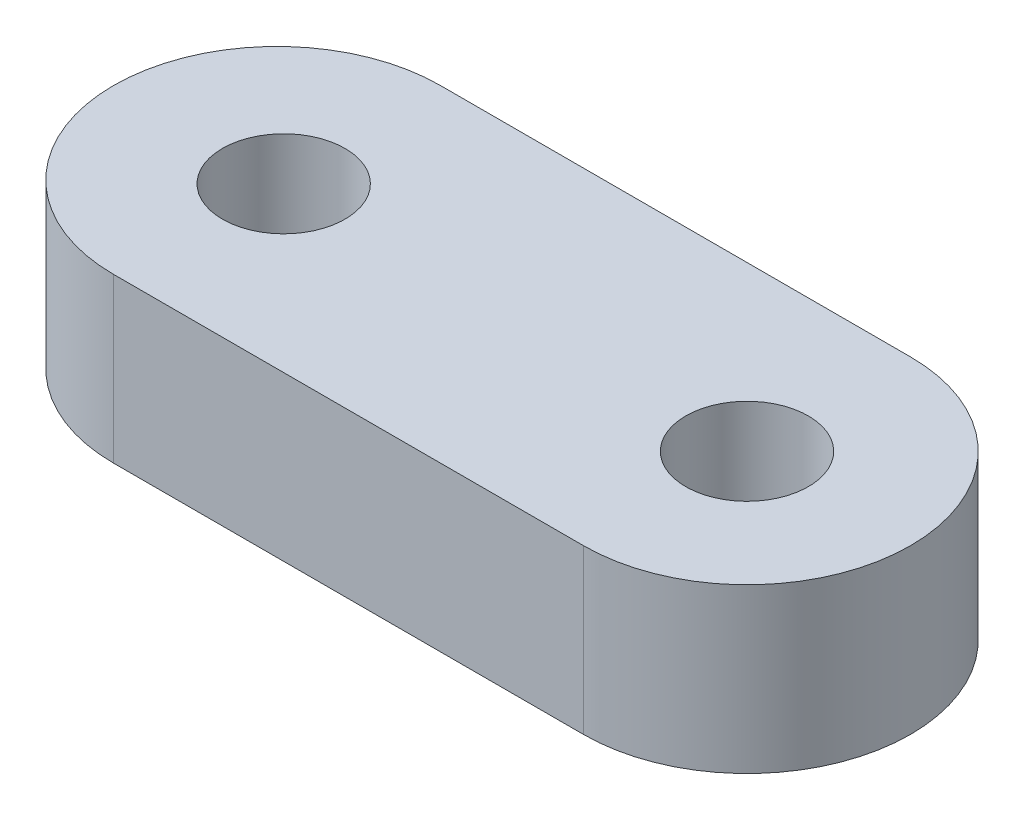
ISO-10303-21;
HEADER;
FILE_DESCRIPTION(('STEP AP214'),'2;1');
FILE_NAME('part.step','',(''),(''),'','','');
FILE_SCHEMA(('AUTOMOTIVE_DESIGN { 1 0 10303 214 1 1 1 1 }'));
ENDSEC;
DATA;
#1=APPLICATION_CONTEXT('core data for automotive mechanical design processes');
#2=APPLICATION_PROTOCOL_DEFINITION('international standard','automotive_design',2000,#1);
#3=PRODUCT_CONTEXT('',#1,'mechanical');
#4=PRODUCT('Part','Part','',(#3));
#5=PRODUCT_RELATED_PRODUCT_CATEGORY('part','',(#4));
#6=PRODUCT_DEFINITION_FORMATION('','',#4);
#7=PRODUCT_DEFINITION_CONTEXT('part definition',#1,'design');
#8=PRODUCT_DEFINITION('design','',#6,#7);
#9=PRODUCT_DEFINITION_SHAPE('','',#8);
#10=(LENGTH_UNIT() NAMED_UNIT(*) SI_UNIT(.MILLI.,.METRE.));
#11=(NAMED_UNIT(*) PLANE_ANGLE_UNIT() SI_UNIT($,.RADIAN.));
#12=(NAMED_UNIT(*) SI_UNIT($,.STERADIAN.) SOLID_ANGLE_UNIT());
#13=UNCERTAINTY_MEASURE_WITH_UNIT(LENGTH_MEASURE(1.E-05),#10,'distance_accuracy_value','');
#14=(GEOMETRIC_REPRESENTATION_CONTEXT(3) GLOBAL_UNCERTAINTY_ASSIGNED_CONTEXT((#13)) GLOBAL_UNIT_ASSIGNED_CONTEXT((#10,
#11,#12)) REPRESENTATION_CONTEXT('',''));
#15=CARTESIAN_POINT('',(0.,0.,0.));
#16=DIRECTION('',(0.,0.,1.));
#17=DIRECTION('',(1.,0.,0.));
#18=AXIS2_PLACEMENT_3D('',#15,#16,#17);
#19=CARTESIAN_POINT('',(22.67,4.,0.));
#20=DIRECTION('',(0.,-1.,0.));
#21=DIRECTION('',(1.,0.,0.));
#22=AXIS2_PLACEMENT_3D('',#19,#20,#21);
#23=CYLINDRICAL_SURFACE('',#22,8.);
#24=DIRECTION('',(0.,-1.,0.));
#25=VECTOR('',#24,1.);
#26=CARTESIAN_POINT('',(22.67,4.,8.));
#27=LINE('',#26,#25);
#28=CARTESIAN_POINT('',(22.67,-4.,8.));
#29=VERTEX_POINT('',#28);
#30=CARTESIAN_POINT('',(22.67,4.,8.));
#31=VERTEX_POINT('',#30);
#32=EDGE_CURVE('E66',#29,#31,#27,.F.);
#33=ORIENTED_EDGE('',*,*,#32,.F.);
#34=CARTESIAN_POINT('',(22.67,-4.,0.));
#35=DIRECTION('',(0.,-1.,0.));
#36=DIRECTION('',(1.,0.,0.));
#37=AXIS2_PLACEMENT_3D('',#34,#35,#36);
#38=CIRCLE('',#37,8.);
#39=CARTESIAN_POINT('',(22.67,-4.,-8.));
#40=VERTEX_POINT('',#39);
#41=EDGE_CURVE('E18',#29,#40,#38,.F.);
#42=ORIENTED_EDGE('',*,*,#41,.T.);
#43=DIRECTION('',(0.,1.,0.));
#44=VECTOR('',#43,1.);
#45=CARTESIAN_POINT('',(22.67,4.,-8.));
#46=LINE('',#45,#44);
#47=CARTESIAN_POINT('',(22.67,4.,-8.));
#48=VERTEX_POINT('',#47);
#49=EDGE_CURVE('E53',#48,#40,#46,.F.);
#50=ORIENTED_EDGE('',*,*,#49,.F.);
#51=CARTESIAN_POINT('',(22.67,4.,0.));
#52=DIRECTION('',(0.,-1.,0.));
#53=DIRECTION('',(1.,0.,0.));
#54=AXIS2_PLACEMENT_3D('',#51,#52,#53);
#55=CIRCLE('',#54,8.);
#56=EDGE_CURVE('E78',#31,#48,#55,.F.);
#57=ORIENTED_EDGE('',*,*,#56,.F.);
#58=EDGE_LOOP('',(#33,#42,#50,#57));
#59=FACE_BOUND('',#58,.T.);
#60=ADVANCED_FACE('F14',(#59),#23,.T.);
#61=CARTESIAN_POINT('',(-8.33,4.,-8.));
#62=DIRECTION('',(0.,0.,-1.));
#63=DIRECTION('',(0.,1.,0.));
#64=AXIS2_PLACEMENT_3D('',#61,#62,#63);
#65=PLANE('',#64);
#66=ORIENTED_EDGE('',*,*,#49,.T.);
#67=DIRECTION('',(1.,0.,0.));
#68=VECTOR('',#67,1.);
#69=CARTESIAN_POINT('',(-8.33,-4.,-8.));
#70=LINE('',#69,#68);
#71=CARTESIAN_POINT('',(-0.33,-4.,-8.));
#72=VERTEX_POINT('',#71);
#73=EDGE_CURVE('E57',#40,#72,#70,.F.);
#74=ORIENTED_EDGE('',*,*,#73,.T.);
#75=DIRECTION('',(0.,-1.,0.));
#76=VECTOR('',#75,1.);
#77=CARTESIAN_POINT('',(-0.33,4.,-8.));
#78=LINE('',#77,#76);
#79=CARTESIAN_POINT('',(-0.33,4.,-8.));
#80=VERTEX_POINT('',#79);
#81=EDGE_CURVE('E60',#80,#72,#78,.T.);
#82=ORIENTED_EDGE('',*,*,#81,.F.);
#83=DIRECTION('',(-1.,0.,0.));
#84=VECTOR('',#83,1.);
#85=CARTESIAN_POINT('',(-8.33,4.,-8.));
#86=LINE('',#85,#84);
#87=EDGE_CURVE('E58',#48,#80,#86,.T.);
#88=ORIENTED_EDGE('',*,*,#87,.F.);
#89=EDGE_LOOP('',(#66,#74,#82,#88));
#90=FACE_BOUND('',#89,.T.);
#91=ADVANCED_FACE('F55',(#90),#65,.T.);
#92=CARTESIAN_POINT('',(-0.329999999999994,4.,0.));
#93=DIRECTION('',(0.,-1.,0.));
#94=DIRECTION('',(1.,0.,0.));
#95=AXIS2_PLACEMENT_3D('',#92,#93,#94);
#96=CYLINDRICAL_SURFACE('',#95,8.);
#97=DIRECTION('',(0.,-1.,0.));
#98=VECTOR('',#97,1.);
#99=CARTESIAN_POINT('',(-0.329999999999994,4.,8.));
#100=LINE('',#99,#98);
#101=CARTESIAN_POINT('',(-0.329999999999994,4.,8.));
#102=VERTEX_POINT('',#101);
#103=CARTESIAN_POINT('',(-0.329999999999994,-4.,8.));
#104=VERTEX_POINT('',#103);
#105=EDGE_CURVE('E80',#102,#104,#100,.T.);
#106=ORIENTED_EDGE('',*,*,#105,.F.);
#107=CARTESIAN_POINT('',(-0.329999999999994,4.,0.));
#108=DIRECTION('',(0.,-1.,0.));
#109=DIRECTION('',(1.,0.,0.));
#110=AXIS2_PLACEMENT_3D('',#107,#108,#109);
#111=CIRCLE('',#110,8.);
#112=EDGE_CURVE('E24',#80,#102,#111,.F.);
#113=ORIENTED_EDGE('',*,*,#112,.F.);
#114=ORIENTED_EDGE('',*,*,#81,.T.);
#115=CARTESIAN_POINT('',(-0.329999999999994,-4.,0.));
#116=DIRECTION('',(0.,-1.,0.));
#117=DIRECTION('',(1.,0.,0.));
#118=AXIS2_PLACEMENT_3D('',#115,#116,#117);
#119=CIRCLE('',#118,8.);
#120=EDGE_CURVE('E74',#72,#104,#119,.F.);
#121=ORIENTED_EDGE('',*,*,#120,.T.);
#122=EDGE_LOOP('',(#106,#113,#114,#121));
#123=FACE_BOUND('',#122,.T.);
#124=ADVANCED_FACE('F111',(#123),#96,.T.);
#125=CARTESIAN_POINT('',(-8.33,4.,8.));
#126=DIRECTION('',(0.,0.,1.));
#127=DIRECTION('',(0.,-1.,0.));
#128=AXIS2_PLACEMENT_3D('',#125,#126,#127);
#129=PLANE('',#128);
#130=DIRECTION('',(-1.,0.,0.));
#131=VECTOR('',#130,1.);
#132=CARTESIAN_POINT('',(-8.33,4.,8.));
#133=LINE('',#132,#131);
#134=EDGE_CURVE('E9',#102,#31,#133,.F.);
#135=ORIENTED_EDGE('',*,*,#134,.F.);
#136=ORIENTED_EDGE('',*,*,#105,.T.);
#137=DIRECTION('',(1.,0.,0.));
#138=VECTOR('',#137,1.);
#139=CARTESIAN_POINT('',(-8.33,-4.,8.));
#140=LINE('',#139,#138);
#141=EDGE_CURVE('E61',#104,#29,#140,.T.);
#142=ORIENTED_EDGE('',*,*,#141,.T.);
#143=ORIENTED_EDGE('',*,*,#32,.T.);
#144=EDGE_LOOP('',(#135,#136,#142,#143));
#145=FACE_BOUND('',#144,.T.);
#146=ADVANCED_FACE('F102',(#145),#129,.T.);
#147=CARTESIAN_POINT('',(-8.33,4.,-8.));
#148=DIRECTION('',(0.,1.,0.));
#149=DIRECTION('',(-1.,0.,0.));
#150=AXIS2_PLACEMENT_3D('',#147,#148,#149);
#151=PLANE('',#150);
#152=ORIENTED_EDGE('',*,*,#112,.T.);
#153=ORIENTED_EDGE('',*,*,#134,.T.);
#154=ORIENTED_EDGE('',*,*,#56,.T.);
#155=ORIENTED_EDGE('',*,*,#87,.T.);
#156=EDGE_LOOP('',(#152,#153,#154,#155));
#157=FACE_BOUND('',#156,.T.);
#158=CARTESIAN_POINT('',(0.,4.,0.));
#159=DIRECTION('',(0.,1.,0.));
#160=DIRECTION('',(-1.,0.,0.));
#161=AXIS2_PLACEMENT_3D('',#158,#159,#160);
#162=CIRCLE('',#161,3.);
#163=CARTESIAN_POINT('',(-3.,4.,0.));
#164=VERTEX_POINT('',#163);
#165=EDGE_CURVE('E88',#164,#164,#162,.T.);
#166=ORIENTED_EDGE('',*,*,#165,.F.);
#167=EDGE_LOOP('',(#166));
#168=FACE_BOUND('',#167,.T.);
#169=CARTESIAN_POINT('',(22.67,4.,0.));
#170=DIRECTION('',(0.,1.,0.));
#171=DIRECTION('',(-1.,0.,0.));
#172=AXIS2_PLACEMENT_3D('',#169,#170,#171);
#173=CIRCLE('',#172,3.);
#174=CARTESIAN_POINT('',(19.67,4.,0.));
#175=VERTEX_POINT('',#174);
#176=EDGE_CURVE('E94',#175,#175,#173,.T.);
#177=ORIENTED_EDGE('',*,*,#176,.F.);
#178=EDGE_LOOP('',(#177));
#179=FACE_BOUND('',#178,.T.);
#180=ADVANCED_FACE('F100',(#157,#168,#179),#151,.T.);
#181=CARTESIAN_POINT('',(-8.33,-4.,-8.));
#182=DIRECTION('',(0.,1.,0.));
#183=DIRECTION('',(-1.,0.,0.));
#184=AXIS2_PLACEMENT_3D('',#181,#182,#183);
#185=PLANE('',#184);
#186=ORIENTED_EDGE('',*,*,#41,.F.);
#187=ORIENTED_EDGE('',*,*,#141,.F.);
#188=ORIENTED_EDGE('',*,*,#120,.F.);
#189=ORIENTED_EDGE('',*,*,#73,.F.);
#190=EDGE_LOOP('',(#186,#187,#188,#189));
#191=FACE_BOUND('',#190,.T.);
#192=CARTESIAN_POINT('',(0.,-4.,0.));
#193=DIRECTION('',(0.,1.,0.));
#194=DIRECTION('',(-1.,0.,0.));
#195=AXIS2_PLACEMENT_3D('',#192,#193,#194);
#196=CIRCLE('',#195,3.);
#197=CARTESIAN_POINT('',(-3.,-4.,0.));
#198=VERTEX_POINT('',#197);
#199=EDGE_CURVE('E70',#198,#198,#196,.F.);
#200=ORIENTED_EDGE('',*,*,#199,.F.);
#201=EDGE_LOOP('',(#200));
#202=FACE_BOUND('',#201,.T.);
#203=CARTESIAN_POINT('',(22.67,-4.,0.));
#204=DIRECTION('',(0.,1.,0.));
#205=DIRECTION('',(-1.,0.,0.));
#206=AXIS2_PLACEMENT_3D('',#203,#204,#205);
#207=CIRCLE('',#206,3.);
#208=CARTESIAN_POINT('',(19.67,-4.,0.));
#209=VERTEX_POINT('',#208);
#210=EDGE_CURVE('E91',#209,#209,#207,.F.);
#211=ORIENTED_EDGE('',*,*,#210,.F.);
#212=EDGE_LOOP('',(#211));
#213=FACE_BOUND('',#212,.T.);
#214=ADVANCED_FACE('F16',(#191,#202,#213),#185,.F.);
#215=CARTESIAN_POINT('',(0.,-18.6484323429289,0.));
#216=DIRECTION('',(0.,1.,0.));
#217=DIRECTION('',(-1.,0.,0.));
#218=AXIS2_PLACEMENT_3D('',#215,#216,#217);
#219=CYLINDRICAL_SURFACE('',#218,3.);
#220=ORIENTED_EDGE('',*,*,#199,.T.);
#221=EDGE_LOOP('',(#220));
#222=FACE_BOUND('',#221,.T.);
#223=ORIENTED_EDGE('',*,*,#165,.T.);
#224=EDGE_LOOP('',(#223));
#225=FACE_BOUND('',#224,.T.);
#226=ADVANCED_FACE('F110',(#222,#225),#219,.F.);
#227=CARTESIAN_POINT('',(22.67,-18.6484323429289,0.));
#228=DIRECTION('',(0.,1.,0.));
#229=DIRECTION('',(-1.,0.,0.));
#230=AXIS2_PLACEMENT_3D('',#227,#228,#229);
#231=CYLINDRICAL_SURFACE('',#230,3.);
#232=ORIENTED_EDGE('',*,*,#210,.T.);
#233=EDGE_LOOP('',(#232));
#234=FACE_BOUND('',#233,.T.);
#235=ORIENTED_EDGE('',*,*,#176,.T.);
#236=EDGE_LOOP('',(#235));
#237=FACE_BOUND('',#236,.T.);
#238=ADVANCED_FACE('F98',(#234,#237),#231,.F.);
#239=CLOSED_SHELL('',(#60,#91,#124,#146,#180,#214,#226,#238));
#240=MANIFOLD_SOLID_BREP('B1',#239);
#241=ADVANCED_BREP_SHAPE_REPRESENTATION('',(#18,#240),#14);
#242=SHAPE_DEFINITION_REPRESENTATION(#9,#241);
ENDSEC;
END-ISO-10303-21;
